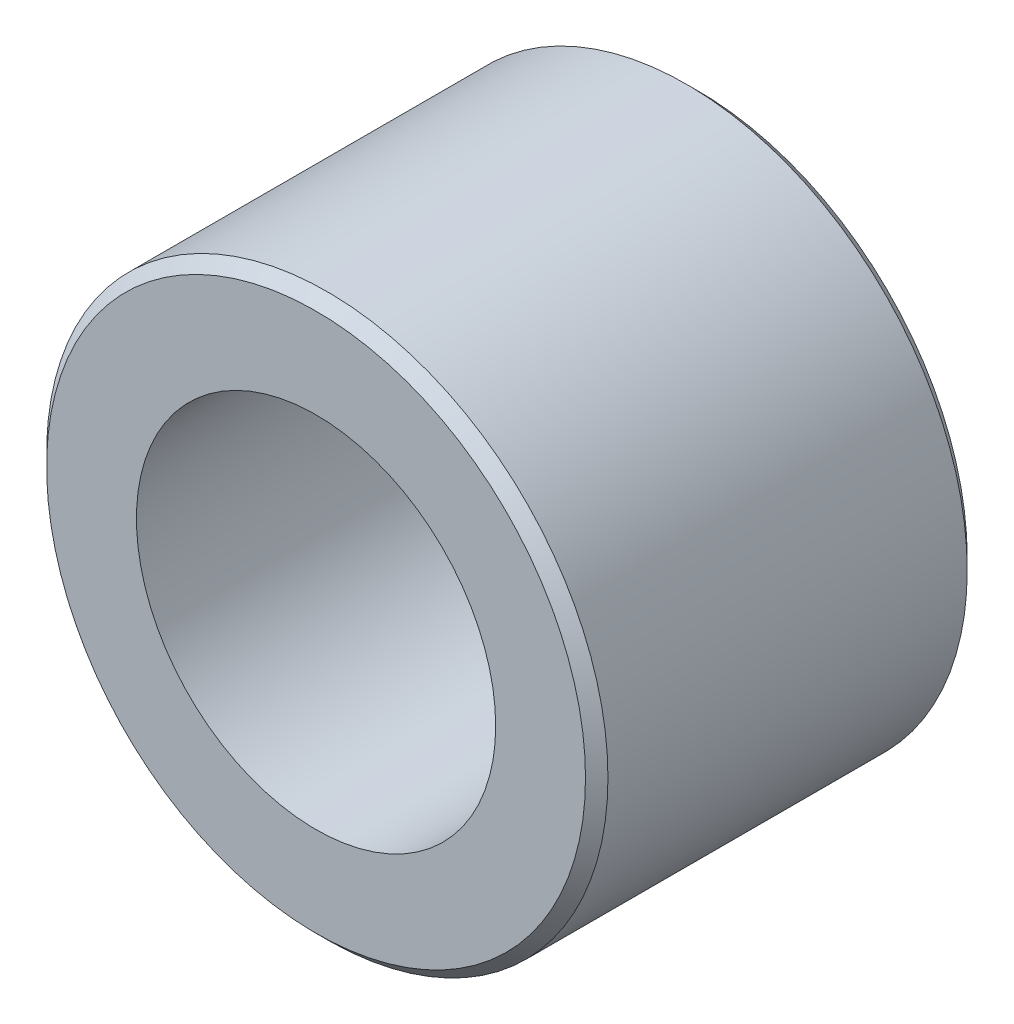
from build123d import *

# Parameters (mm, degrees)
ESQUISSE1_R           = 12.5
ESQUISSE1_R_2         = 8
TUBE_DEPTH            = 17
CHANFREIN_0_5X45_SIZE = 0.5


with BuildPart() as part:
    # Esquisse1 → tube (new body)
    with BuildSketch(Plane.XY):
        Circle(ESQUISSE1_R)
        Circle(ESQUISSE1_R_2, mode=Mode.SUBTRACT)
    extrude(amount=TUBE_DEPTH)

    # Chanfrein 0.5x45
    chanfrein_0_5x45_edges = [part.edges().sort_by_distance(p)[0] for p in [
        (-12.5, 0, 0),
        (-12.5, 0, 17),
    ]]
    chamfer(chanfrein_0_5x45_edges, length=CHANFREIN_0_5X45_SIZE)


solid = part.part
